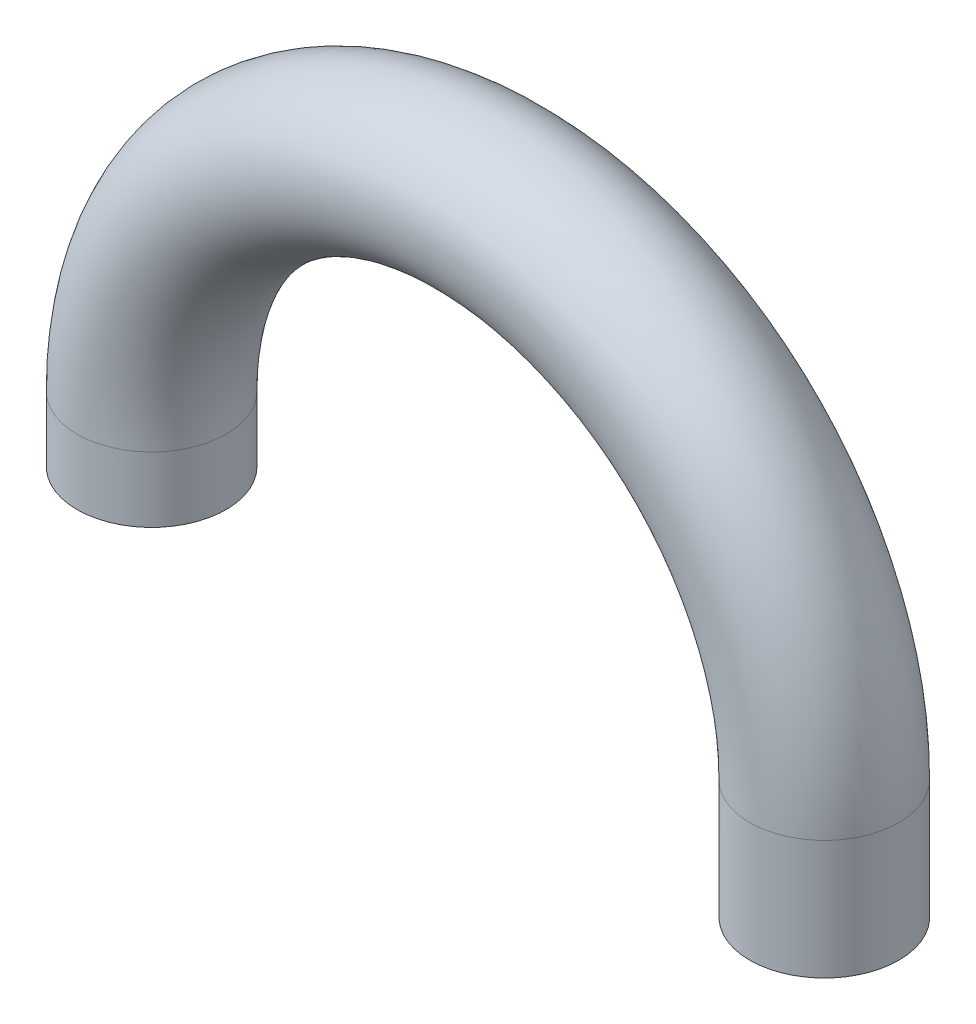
from build123d import *

# Parameters (mm, degrees)
SKETCH2_R = 3.96875


with BuildPart() as part:
    # Sweep1: sweep along a path in Sketch1
    with BuildLine(Plane.XY) as sweep1_path:
        Line((0, 0), (0, 3.4798))
        ThreePointArc((0, 3.4798), (17.915420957, 21.395220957), (35.830841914, 3.4798))
        Line((35.830841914, 3.4798), (35.830841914, -2.8702))
    # Sketch2 → Sweep1 (sweep)
    with BuildSketch(Plane(origin=(0, 0, 0), x_dir=(1, 0, 0), z_dir=(0, 1, 0))):
        Circle(SKETCH2_R)
    sweep(path=sweep1_path.line)


solid = part.part
